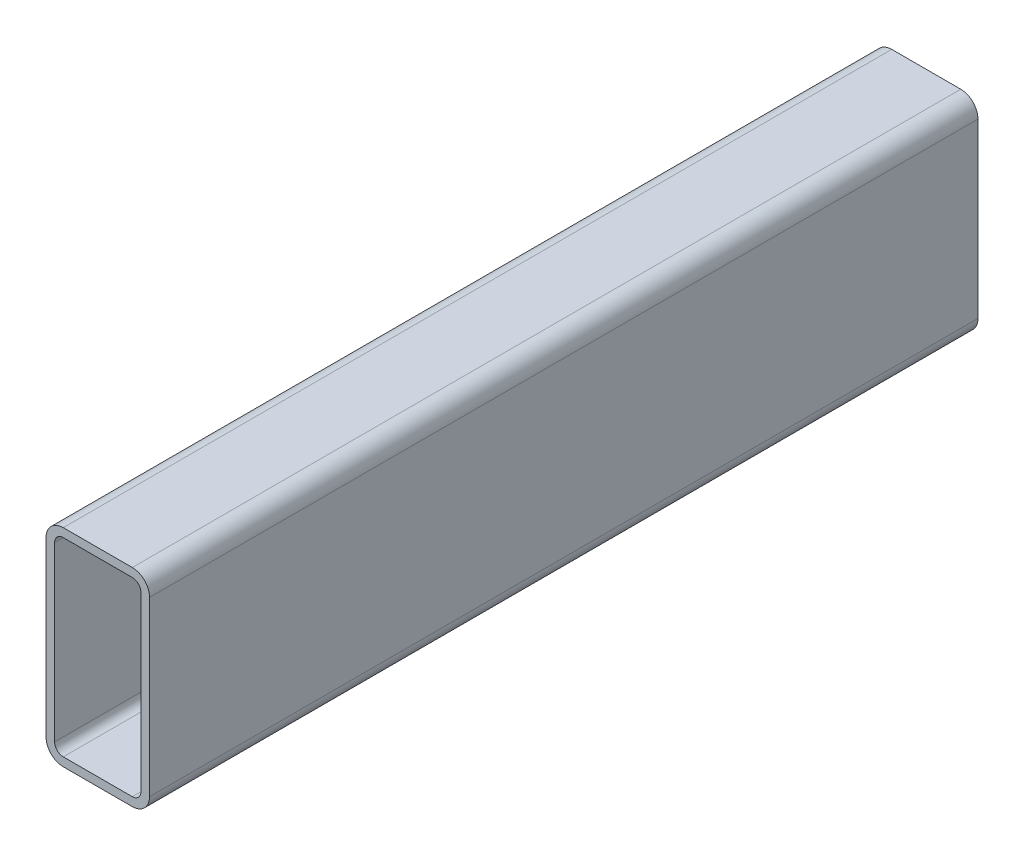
from build123d import *

# Parameters (mm, degrees)
BOSS_EXTRUDE1_DEPTH = 304.8


with BuildPart() as part:
    # Sketch1 → Boss-Extrude1 (new body)
    with BuildSketch(Plane.XY):
        with BuildLine():
            Line((31.75, 76.2), (6.35, 76.2))
            ThreePointArc((6.35, 76.2), (1.859871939, 74.340128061), (0, 69.85))
            Line((0, 69.85), (0, 6.35))
            ThreePointArc((0, 6.35), (1.859871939, 1.859871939), (6.35, 0))
            Line((6.35, 0), (31.75, 0))
            ThreePointArc((31.75, 0), (36.240128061, 1.859871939), (38.1, 6.35))
            Line((38.1, 6.35), (38.1, 69.85))
            ThreePointArc((38.1, 69.85), (36.240128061, 74.340128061), (31.75, 76.2))
        make_face()
        with BuildLine():
            Line((6.35, 73.025), (31.75, 73.025))
            ThreePointArc((31.75, 73.025), (33.99506403, 72.09506403), (34.925, 69.85))
            Line((34.925, 69.85), (34.925, 6.35))
            ThreePointArc((34.925, 6.35), (33.99506403, 4.10493597), (31.75, 3.175))
            Line((31.75, 3.175), (6.35, 3.175))
            ThreePointArc((6.35, 3.175), (4.10493597, 4.10493597), (3.175, 6.35))
            Line((3.175, 6.35), (3.175, 69.85))
            ThreePointArc((3.175, 69.85), (4.10493597, 72.09506403), (6.35, 73.025))
        make_face(mode=Mode.SUBTRACT)
    extrude(amount=BOSS_EXTRUDE1_DEPTH)


solid = part.part
